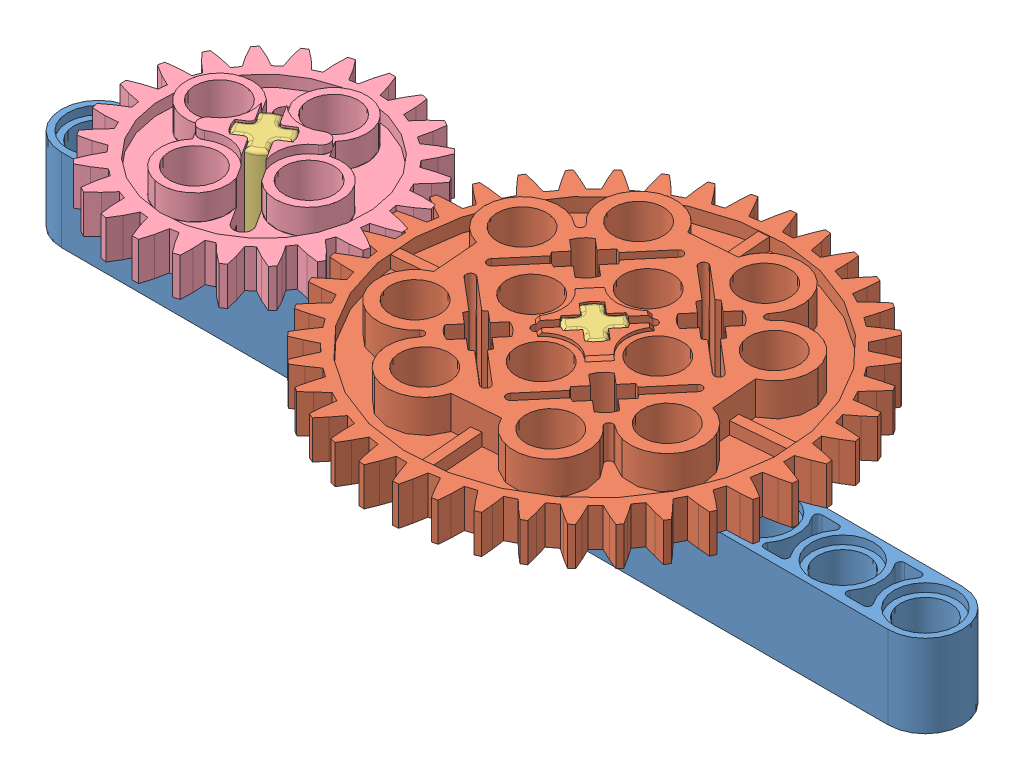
SolidWorks assembly Assem2.sldasm, configuration Default (file format 12000). Lengths in mm.
Overall size (87.2 16 59.34).
5 component instances, 4 part files, 11 mates.
Components (placement in the parent):
- 32525 Beam 11 Yellow-1: 32525 Beam 11 Yellow.SLDPRT [Default] at (-6.9288 40.2418 67.5168) size (87.2 8 7.2)
- 3649 Gear 40 _-1: 3649 Gear 40 _.SLDPRT [Default] at (41.0712 52.2418 67.5168) x (-0.762548 0 -0.646932) z (0.646932 0 -0.762548) size (42.1 8 42.1)
- 3749 Axle Pin without Friction Ridges Lengthwise-1: 3749 Axle Pin without Friction Ridges Lengthwise.SLDPRT [Default] at (41.0712 48.2418 67.5168) x (-0.762548 0 -0.646932) z (0.646932 0 -0.762548) size (6 16 6)
- 3648 Gear 24 Gray-1: 3648 Gear 24 Gray.SLDPRT [Default] at (9.0712 52.2418 67.5168) x (-0.539284 0 -0.842124) z (0.842124 0 -0.539284) size (26.1 8 26.1)
- 3749 Axle Pin without Friction Ridges Lengthwise-2: 3749 Axle Pin without Friction Ridges Lengthwise.SLDPRT [Default] at (9.0712 48.2418 67.5168) x (0.842124 0 -0.539284) z (0.539284 0 0.842124) size (6 16 6)
Mates (geometry in assembly coordinates):
- Concentric1: concentric anti-aligned: cylinder of 32525 Beam 11 Yellow-1 through (9.0712 48.2418 67.5168) axis (0 -1 0) radius 2.4; cylinder of 3749 Axle Pin without Friction Ridges Lengthwise-2 through (9.0712 40.2418 67.5168) axis (0 1 0) radius 2.4
- Coincident1: coincident anti-aligned: plane of 32525 Beam 11 Yellow-1 through (9.0712 47.4418 67.5168) normal (0 1 0); plane of 3749 Axle Pin without Friction Ridges Lengthwise-2 through (9.0712 47.4418 67.5168) normal (0 -1 0)
- Concentric2: concentric anti-aligned: cylinder of 32525 Beam 11 Yellow-1 through (41.0712 48.2418 67.5168) axis (0 -1 0) radius 2.4; cylinder of 3749 Axle Pin without Friction Ridges Lengthwise-1 through (41.0712 40.2418 67.5168) axis (0 1 0) radius 2.4
- Coincident2: coincident anti-aligned: plane of 32525 Beam 11 Yellow-1 through (41.0712 47.4418 67.5168) normal (0 1 0); plane of 3749 Axle Pin without Friction Ridges Lengthwise-1 through (41.0712 47.4418 67.5168) normal (0 -1 0)
- Concentric3: concentric anti-aligned: cylinder of 3648 Gear 24 Gray-1 through (9.0712 48.2418 67.5168) axis (0 1 0) radius 2.4; cylinder of 3749 Axle Pin without Friction Ridges Lengthwise-2 through (9.0712 56.2418 67.5168) axis (0 -1 0) radius 2.4
- Coincident3: coincident anti-aligned: plane of 3648 Gear 24 Gray-1 through (9.3597 48.2418 69.0431) normal (-0.914919 0 -0.403638); plane of 3749 Axle Pin without Friction Ridges Lengthwise-2 through (10.393 56.2418 66.7009) normal (0.914919 0 0.403638)
- Coincident4: coincident anti-aligned: plane of 32525 Beam 11 Yellow-1 through (-6.9288 48.2418 67.5168) normal (0 1 0); plane of 3648 Gear 24 Gray-1 through (7.498 48.2418 71.1745) normal (0 -1 0)
- Concentric4: concentric anti-aligned: cylinder of 3649 Gear 40 _-1 through (41.0712 48.2418 67.5168) axis (0 1 0) radius 2.4; cylinder of 3749 Axle Pin without Friction Ridges Lengthwise-1 through (41.0712 56.2418 67.5168) axis (0 -1 0) radius 2.4
- Coincident6: coincident anti-aligned: plane of 3649 Gear 40 _-1 through (41.1526 48.2418 66.275) normal (0.659328 0 0.751855); plane of 3749 Axle Pin without Friction Ridges Lengthwise-1 through (39.5286 56.2418 67.6991) normal (-0.659328 0 -0.751855)
- Coincident7: coincident anti-aligned: plane of 32525 Beam 11 Yellow-1 through (-6.9288 48.2418 67.5168) normal (0 1 0); plane of 3649 Gear 40 _-1 through (41.4413 48.2418 61.8721) normal (0 -1 0)
- GearMate1: gear = 37.5 mm: circle of 3648 Gear 24 Gray-1; circle of 3649 Gear 40 _-1
